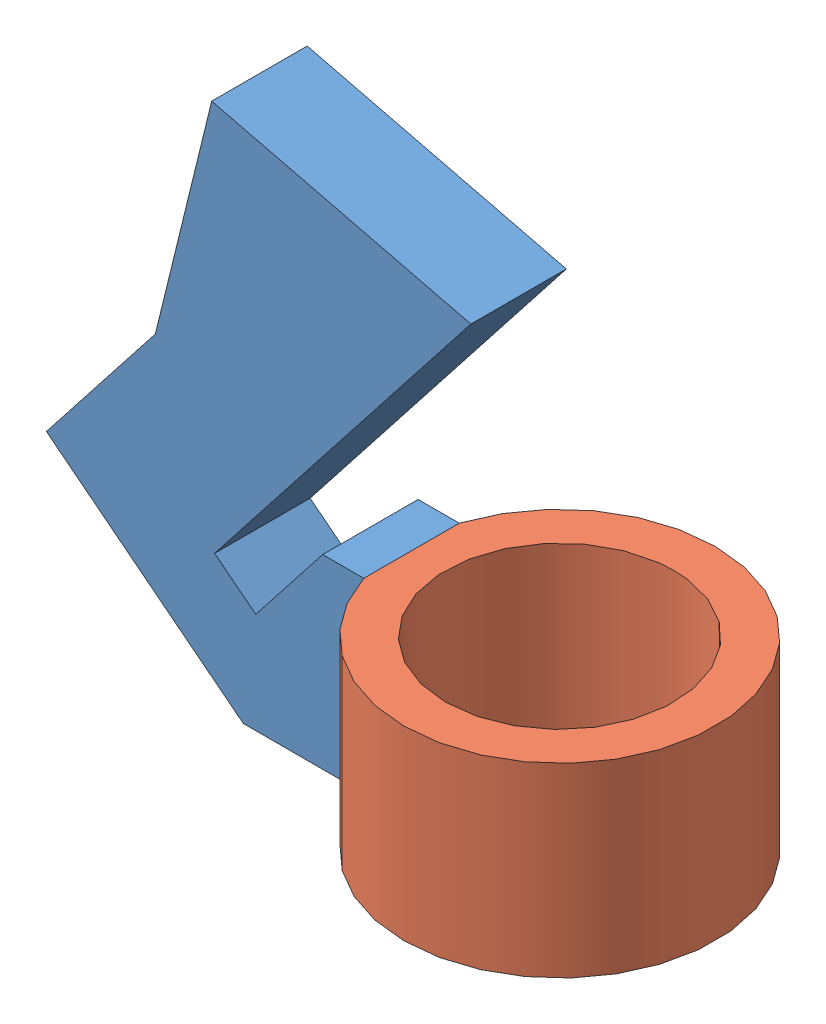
SolidWorks assembly CCD mirror camera connector .SLDASM, configuration Default (file format 3100). Lengths in mm.
Overall size (68.68 36.24 19.05).
2 component instances, 2 part files, 2 mates.
Components (placement in the parent):
- CCD mirror camera connector holder-1: CCD mirror camera connector holder.SLDPRT [Default] at (-42.4683 -6.1931 -2.921) size (68.68 36.24 5.84)
- CCD mirror camera connector ring-1: CCD mirror camera connector ring.SLDPRT [Default] at (-33.4023 -6.1931 0) x (0 0 -1) z (0 1 0) size (19.05 18.59 11.38)
Mates (geometry in assembly coordinates):
- Parallel1: parallel anti-aligned: plane of CCD mirror camera connector holder-1 through (-42.4683 5.1861 2.921) normal (1 0 0); plane of CCD mirror camera connector ring-1 through (-42.4683 -6.1931 2.921) normal (-1 0 0)
- Coincident5: coincident: moEndPointRef_w of CCD mirror camera connector holder-1; moEndPointRef_w of CCD mirror camera connector ring-1
